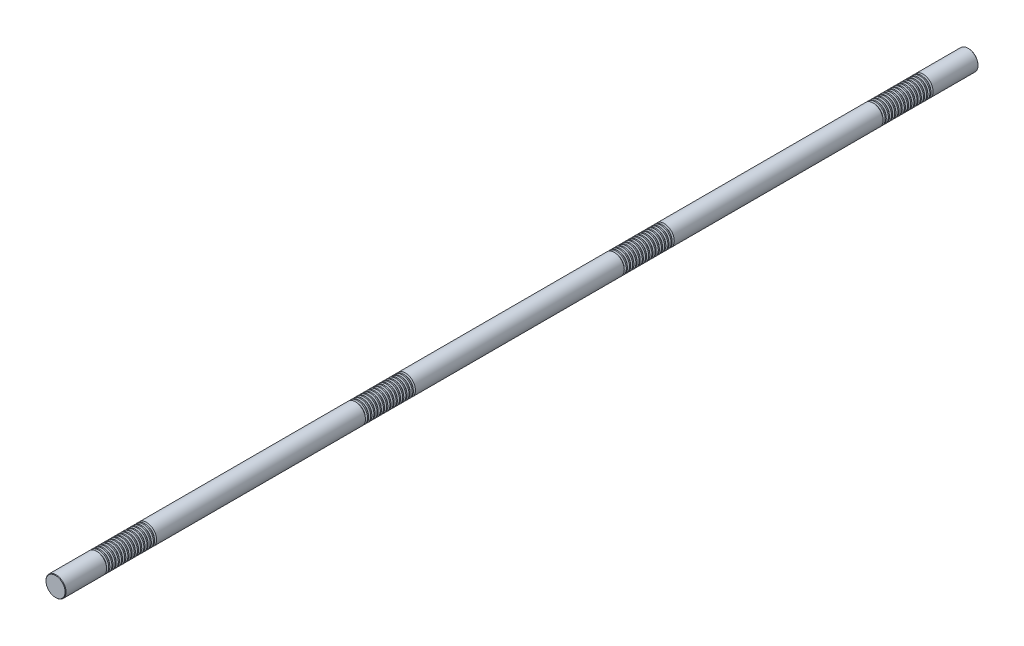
from build123d import *

# Parameters (mm, degrees)
SKETCH1_R           = 22
BOSS_EXTRUDE1_DEPTH = 1000
CHAMFER1_SIZE       = 1.1
LPATTERN1_COUNT     = 16
LPATTERN1_PITCH     = 7
LPATTERN2_COUNT     = 4
LPATTERN2_PITCH     = 567


with BuildPart() as part:
    # Sketch1 → Boss-Extrude1 (new, symmetric)
    with BuildSketch(Plane.XY):
        Circle(SKETCH1_R)
    extrude(amount=BOSS_EXTRUDE1_DEPTH, both=True)

    # Chamfer1
    chamfer1_edges = [part.edges().sort_by_distance(p)[0] for p in [
        (-22, 0, -1000),
        (-22, 0, 1000),
    ]]
    chamfer(chamfer1_edges, length=CHAMFER1_SIZE)

    # Sketch2 → Cut-Revolve1 (revolve, cut)
    with BuildSketch(Plane(origin=(0, 0, 0), x_dir=(0, 0, -1), z_dir=(1, 0, 0)), mode=Mode.PRIVATE) as cut_revolve1_sk:
        Polygon((900.535898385, 22), (895.964101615, 22), (897.035898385, 18), (899.464101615, 18), align=None)
    cut_revolve1 = revolve(cut_revolve1_sk.sketch.rotate(Axis((0, 0, 1000), (0, 0, -1)), 90), axis=Axis((0, 0, 1000), (0, 0, -1)), mode=Mode.SUBTRACT)

    # LPattern1: Cut-Revolve1 ×16
    with Locations(*[(0, 0, i * LPATTERN1_PITCH) for i in range(1, LPATTERN1_COUNT)]):
        add(cut_revolve1, mode=Mode.SUBTRACT)

    # LPattern2: Cut-Revolve1 ×4
    with Locations(*[(0, 0, i * LPATTERN2_PITCH) for i in range(1, LPATTERN2_COUNT)]):
        add(cut_revolve1, mode=Mode.SUBTRACT)

    # LPattern2 copy 1 sketch → LPattern2 copy 1 (revolve, cut)
    with BuildSketch(Plane(origin=(0, 0, 574), x_dir=(0, 0, -1), z_dir=(1, 0, 0))):
        Polygon((900.535898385, 22), (895.964101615, 22), (897.035898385, 18), (899.464101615, 18), align=None)
    revolve(axis=Axis((0, 0, 1574), (0, 0, -1)), mode=Mode.SUBTRACT)

    # LPattern2 copy 2 sketch → LPattern2 copy 2 (revolve, cut)
    with BuildSketch(Plane(origin=(0, 0, 1141), x_dir=(0, 0, -1), z_dir=(1, 0, 0))):
        Polygon((900.535898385, 22), (895.964101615, 22), (897.035898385, 18), (899.464101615, 18), align=None)
    revolve(axis=Axis((0, 0, 2141), (0, 0, -1)), mode=Mode.SUBTRACT)

    # LPattern2 copy 3 sketch → LPattern2 copy 3 (revolve, cut)
    with BuildSketch(Plane(origin=(0, 0, 1708), x_dir=(0, 0, -1), z_dir=(1, 0, 0))):
        Polygon((900.535898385, 22), (895.964101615, 22), (897.035898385, 18), (899.464101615, 18), align=None)
    revolve(axis=Axis((0, 0, 2708), (0, 0, -1)), mode=Mode.SUBTRACT)

    # LPattern2 copy 4 sketch → LPattern2 copy 4 (revolve, cut)
    with BuildSketch(Plane(origin=(0, 0, 581), x_dir=(0, 0, -1), z_dir=(1, 0, 0))):
        Polygon((900.535898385, 22), (895.964101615, 22), (897.035898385, 18), (899.464101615, 18), align=None)
    revolve(axis=Axis((0, 0, 1581), (0, 0, -1)), mode=Mode.SUBTRACT)

    # LPattern2 copy 5 sketch → LPattern2 copy 5 (revolve, cut)
    with BuildSketch(Plane(origin=(0, 0, 1148), x_dir=(0, 0, -1), z_dir=(1, 0, 0))):
        Polygon((900.535898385, 22), (895.964101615, 22), (897.035898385, 18), (899.464101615, 18), align=None)
    revolve(axis=Axis((0, 0, 2148), (0, 0, -1)), mode=Mode.SUBTRACT)

    # LPattern2 copy 6 sketch → LPattern2 copy 6 (revolve, cut)
    with BuildSketch(Plane(origin=(0, 0, 1715), x_dir=(0, 0, -1), z_dir=(1, 0, 0))):
        Polygon((900.535898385, 22), (895.964101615, 22), (897.035898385, 18), (899.464101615, 18), align=None)
    revolve(axis=Axis((0, 0, 2715), (0, 0, -1)), mode=Mode.SUBTRACT)

    # LPattern2 copy 7 sketch → LPattern2 copy 7 (revolve, cut)
    with BuildSketch(Plane(origin=(0, 0, 588), x_dir=(0, 0, -1), z_dir=(1, 0, 0))):
        Polygon((900.535898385, 22), (895.964101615, 22), (897.035898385, 18), (899.464101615, 18), align=None)
    revolve(axis=Axis((0, 0, 1588), (0, 0, -1)), mode=Mode.SUBTRACT)

    # LPattern2 copy 8 sketch → LPattern2 copy 8 (revolve, cut)
    with BuildSketch(Plane(origin=(0, 0, 1155), x_dir=(0, 0, -1), z_dir=(1, 0, 0))):
        Polygon((900.535898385, 22), (895.964101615, 22), (897.035898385, 18), (899.464101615, 18), align=None)
    revolve(axis=Axis((0, 0, 2155), (0, 0, -1)), mode=Mode.SUBTRACT)

    # LPattern2 copy 9 sketch → LPattern2 copy 9 (revolve, cut)
    with BuildSketch(Plane(origin=(0, 0, 1722), x_dir=(0, 0, -1), z_dir=(1, 0, 0))):
        Polygon((900.535898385, 22), (895.964101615, 22), (897.035898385, 18), (899.464101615, 18), align=None)
    revolve(axis=Axis((0, 0, 2722), (0, 0, -1)), mode=Mode.SUBTRACT)

    # LPattern2 copy 10 sketch → LPattern2 copy 10 (revolve, cut)
    with BuildSketch(Plane(origin=(0, 0, 595), x_dir=(0, 0, -1), z_dir=(1, 0, 0))):
        Polygon((900.535898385, 22), (895.964101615, 22), (897.035898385, 18), (899.464101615, 18), align=None)
    revolve(axis=Axis((0, 0, 1595), (0, 0, -1)), mode=Mode.SUBTRACT)

    # LPattern2 copy 11 sketch → LPattern2 copy 11 (revolve, cut)
    with BuildSketch(Plane(origin=(0, 0, 1162), x_dir=(0, 0, -1), z_dir=(1, 0, 0))):
        Polygon((900.535898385, 22), (895.964101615, 22), (897.035898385, 18), (899.464101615, 18), align=None)
    revolve(axis=Axis((0, 0, 2162), (0, 0, -1)), mode=Mode.SUBTRACT)

    # LPattern2 copy 12 sketch → LPattern2 copy 12 (revolve, cut)
    with BuildSketch(Plane(origin=(0, 0, 1729), x_dir=(0, 0, -1), z_dir=(1, 0, 0))):
        Polygon((900.535898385, 22), (895.964101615, 22), (897.035898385, 18), (899.464101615, 18), align=None)
    revolve(axis=Axis((0, 0, 2729), (0, 0, -1)), mode=Mode.SUBTRACT)

    # LPattern2 copy 13 sketch → LPattern2 copy 13 (revolve, cut)
    with BuildSketch(Plane(origin=(0, 0, 602), x_dir=(0, 0, -1), z_dir=(1, 0, 0))):
        Polygon((900.535898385, 22), (895.964101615, 22), (897.035898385, 18), (899.464101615, 18), align=None)
    revolve(axis=Axis((0, 0, 1602), (0, 0, -1)), mode=Mode.SUBTRACT)

    # LPattern2 copy 14 sketch → LPattern2 copy 14 (revolve, cut)
    with BuildSketch(Plane(origin=(0, 0, 1169), x_dir=(0, 0, -1), z_dir=(1, 0, 0))):
        Polygon((900.535898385, 22), (895.964101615, 22), (897.035898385, 18), (899.464101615, 18), align=None)
    revolve(axis=Axis((0, 0, 2169), (0, 0, -1)), mode=Mode.SUBTRACT)

    # LPattern2 copy 15 sketch → LPattern2 copy 15 (revolve, cut)
    with BuildSketch(Plane(origin=(0, 0, 1736), x_dir=(0, 0, -1), z_dir=(1, 0, 0))):
        Polygon((900.535898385, 22), (895.964101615, 22), (897.035898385, 18), (899.464101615, 18), align=None)
    revolve(axis=Axis((0, 0, 2736), (0, 0, -1)), mode=Mode.SUBTRACT)

    # LPattern2 copy 16 sketch → LPattern2 copy 16 (revolve, cut)
    with BuildSketch(Plane(origin=(0, 0, 609), x_dir=(0, 0, -1), z_dir=(1, 0, 0))):
        Polygon((900.535898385, 22), (895.964101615, 22), (897.035898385, 18), (899.464101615, 18), align=None)
    revolve(axis=Axis((0, 0, 1609), (0, 0, -1)), mode=Mode.SUBTRACT)

    # LPattern2 copy 17 sketch → LPattern2 copy 17 (revolve, cut)
    with BuildSketch(Plane(origin=(0, 0, 1176), x_dir=(0, 0, -1), z_dir=(1, 0, 0))):
        Polygon((900.535898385, 22), (895.964101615, 22), (897.035898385, 18), (899.464101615, 18), align=None)
    revolve(axis=Axis((0, 0, 2176), (0, 0, -1)), mode=Mode.SUBTRACT)

    # LPattern2 copy 18 sketch → LPattern2 copy 18 (revolve, cut)
    with BuildSketch(Plane(origin=(0, 0, 1743), x_dir=(0, 0, -1), z_dir=(1, 0, 0))):
        Polygon((900.535898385, 22), (895.964101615, 22), (897.035898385, 18), (899.464101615, 18), align=None)
    revolve(axis=Axis((0, 0, 2743), (0, 0, -1)), mode=Mode.SUBTRACT)

    # LPattern2 copy 19 sketch → LPattern2 copy 19 (revolve, cut)
    with BuildSketch(Plane(origin=(0, 0, 616), x_dir=(0, 0, -1), z_dir=(1, 0, 0))):
        Polygon((900.535898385, 22), (895.964101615, 22), (897.035898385, 18), (899.464101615, 18), align=None)
    revolve(axis=Axis((0, 0, 1616), (0, 0, -1)), mode=Mode.SUBTRACT)

    # LPattern2 copy 20 sketch → LPattern2 copy 20 (revolve, cut)
    with BuildSketch(Plane(origin=(0, 0, 1183), x_dir=(0, 0, -1), z_dir=(1, 0, 0))):
        Polygon((900.535898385, 22), (895.964101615, 22), (897.035898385, 18), (899.464101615, 18), align=None)
    revolve(axis=Axis((0, 0, 2183), (0, 0, -1)), mode=Mode.SUBTRACT)

    # LPattern2 copy 21 sketch → LPattern2 copy 21 (revolve, cut)
    with BuildSketch(Plane(origin=(0, 0, 1750), x_dir=(0, 0, -1), z_dir=(1, 0, 0))):
        Polygon((900.535898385, 22), (895.964101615, 22), (897.035898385, 18), (899.464101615, 18), align=None)
    revolve(axis=Axis((0, 0, 2750), (0, 0, -1)), mode=Mode.SUBTRACT)

    # LPattern2 copy 22 sketch → LPattern2 copy 22 (revolve, cut)
    with BuildSketch(Plane(origin=(0, 0, 623), x_dir=(0, 0, -1), z_dir=(1, 0, 0))):
        Polygon((900.535898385, 22), (895.964101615, 22), (897.035898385, 18), (899.464101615, 18), align=None)
    revolve(axis=Axis((0, 0, 1623), (0, 0, -1)), mode=Mode.SUBTRACT)

    # LPattern2 copy 23 sketch → LPattern2 copy 23 (revolve, cut)
    with BuildSketch(Plane(origin=(0, 0, 1190), x_dir=(0, 0, -1), z_dir=(1, 0, 0))):
        Polygon((900.535898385, 22), (895.964101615, 22), (897.035898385, 18), (899.464101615, 18), align=None)
    revolve(axis=Axis((0, 0, 2190), (0, 0, -1)), mode=Mode.SUBTRACT)

    # LPattern2 copy 24 sketch → LPattern2 copy 24 (revolve, cut)
    with BuildSketch(Plane(origin=(0, 0, 1757), x_dir=(0, 0, -1), z_dir=(1, 0, 0))):
        Polygon((900.535898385, 22), (895.964101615, 22), (897.035898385, 18), (899.464101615, 18), align=None)
    revolve(axis=Axis((0, 0, 2757), (0, 0, -1)), mode=Mode.SUBTRACT)

    # LPattern2 copy 25 sketch → LPattern2 copy 25 (revolve, cut)
    with BuildSketch(Plane(origin=(0, 0, 630), x_dir=(0, 0, -1), z_dir=(1, 0, 0))):
        Polygon((900.535898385, 22), (895.964101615, 22), (897.035898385, 18), (899.464101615, 18), align=None)
    revolve(axis=Axis((0, 0, 1630), (0, 0, -1)), mode=Mode.SUBTRACT)

    # LPattern2 copy 26 sketch → LPattern2 copy 26 (revolve, cut)
    with BuildSketch(Plane(origin=(0, 0, 1197), x_dir=(0, 0, -1), z_dir=(1, 0, 0))):
        Polygon((900.535898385, 22), (895.964101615, 22), (897.035898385, 18), (899.464101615, 18), align=None)
    revolve(axis=Axis((0, 0, 2197), (0, 0, -1)), mode=Mode.SUBTRACT)

    # LPattern2 copy 27 sketch → LPattern2 copy 27 (revolve, cut)
    with BuildSketch(Plane(origin=(0, 0, 1764), x_dir=(0, 0, -1), z_dir=(1, 0, 0))):
        Polygon((900.535898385, 22), (895.964101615, 22), (897.035898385, 18), (899.464101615, 18), align=None)
    revolve(axis=Axis((0, 0, 2764), (0, 0, -1)), mode=Mode.SUBTRACT)

    # LPattern2 copy 28 sketch → LPattern2 copy 28 (revolve, cut)
    with BuildSketch(Plane(origin=(0, 0, 637), x_dir=(0, 0, -1), z_dir=(1, 0, 0))):
        Polygon((900.535898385, 22), (895.964101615, 22), (897.035898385, 18), (899.464101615, 18), align=None)
    revolve(axis=Axis((0, 0, 1637), (0, 0, -1)), mode=Mode.SUBTRACT)

    # LPattern2 copy 29 sketch → LPattern2 copy 29 (revolve, cut)
    with BuildSketch(Plane(origin=(0, 0, 1204), x_dir=(0, 0, -1), z_dir=(1, 0, 0))):
        Polygon((900.535898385, 22), (895.964101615, 22), (897.035898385, 18), (899.464101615, 18), align=None)
    revolve(axis=Axis((0, 0, 2204), (0, 0, -1)), mode=Mode.SUBTRACT)

    # LPattern2 copy 30 sketch → LPattern2 copy 30 (revolve, cut)
    with BuildSketch(Plane(origin=(0, 0, 1771), x_dir=(0, 0, -1), z_dir=(1, 0, 0))):
        Polygon((900.535898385, 22), (895.964101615, 22), (897.035898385, 18), (899.464101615, 18), align=None)
    revolve(axis=Axis((0, 0, 2771), (0, 0, -1)), mode=Mode.SUBTRACT)

    # LPattern2 copy 31 sketch → LPattern2 copy 31 (revolve, cut)
    with BuildSketch(Plane(origin=(0, 0, 644), x_dir=(0, 0, -1), z_dir=(1, 0, 0))):
        Polygon((900.535898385, 22), (895.964101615, 22), (897.035898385, 18), (899.464101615, 18), align=None)
    revolve(axis=Axis((0, 0, 1644), (0, 0, -1)), mode=Mode.SUBTRACT)

    # LPattern2 copy 32 sketch → LPattern2 copy 32 (revolve, cut)
    with BuildSketch(Plane(origin=(0, 0, 1211), x_dir=(0, 0, -1), z_dir=(1, 0, 0))):
        Polygon((900.535898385, 22), (895.964101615, 22), (897.035898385, 18), (899.464101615, 18), align=None)
    revolve(axis=Axis((0, 0, 2211), (0, 0, -1)), mode=Mode.SUBTRACT)

    # LPattern2 copy 33 sketch → LPattern2 copy 33 (revolve, cut)
    with BuildSketch(Plane(origin=(0, 0, 1778), x_dir=(0, 0, -1), z_dir=(1, 0, 0))):
        Polygon((900.535898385, 22), (895.964101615, 22), (897.035898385, 18), (899.464101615, 18), align=None)
    revolve(axis=Axis((0, 0, 2778), (0, 0, -1)), mode=Mode.SUBTRACT)

    # LPattern2 copy 34 sketch → LPattern2 copy 34 (revolve, cut)
    with BuildSketch(Plane(origin=(0, 0, 651), x_dir=(0, 0, -1), z_dir=(1, 0, 0))):
        Polygon((900.535898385, 22), (895.964101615, 22), (897.035898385, 18), (899.464101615, 18), align=None)
    revolve(axis=Axis((0, 0, 1651), (0, 0, -1)), mode=Mode.SUBTRACT)

    # LPattern2 copy 35 sketch → LPattern2 copy 35 (revolve, cut)
    with BuildSketch(Plane(origin=(0, 0, 1218), x_dir=(0, 0, -1), z_dir=(1, 0, 0))):
        Polygon((900.535898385, 22), (895.964101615, 22), (897.035898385, 18), (899.464101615, 18), align=None)
    revolve(axis=Axis((0, 0, 2218), (0, 0, -1)), mode=Mode.SUBTRACT)

    # LPattern2 copy 36 sketch → LPattern2 copy 36 (revolve, cut)
    with BuildSketch(Plane(origin=(0, 0, 1785), x_dir=(0, 0, -1), z_dir=(1, 0, 0))):
        Polygon((900.535898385, 22), (895.964101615, 22), (897.035898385, 18), (899.464101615, 18), align=None)
    revolve(axis=Axis((0, 0, 2785), (0, 0, -1)), mode=Mode.SUBTRACT)

    # LPattern2 copy 37 sketch → LPattern2 copy 37 (revolve, cut)
    with BuildSketch(Plane(origin=(0, 0, 658), x_dir=(0, 0, -1), z_dir=(1, 0, 0))):
        Polygon((900.535898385, 22), (895.964101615, 22), (897.035898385, 18), (899.464101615, 18), align=None)
    revolve(axis=Axis((0, 0, 1658), (0, 0, -1)), mode=Mode.SUBTRACT)

    # LPattern2 copy 38 sketch → LPattern2 copy 38 (revolve, cut)
    with BuildSketch(Plane(origin=(0, 0, 1225), x_dir=(0, 0, -1), z_dir=(1, 0, 0))):
        Polygon((900.535898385, 22), (895.964101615, 22), (897.035898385, 18), (899.464101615, 18), align=None)
    revolve(axis=Axis((0, 0, 2225), (0, 0, -1)), mode=Mode.SUBTRACT)

    # LPattern2 copy 39 sketch → LPattern2 copy 39 (revolve, cut)
    with BuildSketch(Plane(origin=(0, 0, 1792), x_dir=(0, 0, -1), z_dir=(1, 0, 0))):
        Polygon((900.535898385, 22), (895.964101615, 22), (897.035898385, 18), (899.464101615, 18), align=None)
    revolve(axis=Axis((0, 0, 2792), (0, 0, -1)), mode=Mode.SUBTRACT)

    # LPattern2 copy 40 sketch → LPattern2 copy 40 (revolve, cut)
    with BuildSketch(Plane(origin=(0, 0, 665), x_dir=(0, 0, -1), z_dir=(1, 0, 0))):
        Polygon((900.535898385, 22), (895.964101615, 22), (897.035898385, 18), (899.464101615, 18), align=None)
    revolve(axis=Axis((0, 0, 1665), (0, 0, -1)), mode=Mode.SUBTRACT)

    # LPattern2 copy 41 sketch → LPattern2 copy 41 (revolve, cut)
    with BuildSketch(Plane(origin=(0, 0, 1232), x_dir=(0, 0, -1), z_dir=(1, 0, 0))):
        Polygon((900.535898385, 22), (895.964101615, 22), (897.035898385, 18), (899.464101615, 18), align=None)
    revolve(axis=Axis((0, 0, 2232), (0, 0, -1)), mode=Mode.SUBTRACT)

    # LPattern2 copy 42 sketch → LPattern2 copy 42 (revolve, cut)
    with BuildSketch(Plane(origin=(0, 0, 1799), x_dir=(0, 0, -1), z_dir=(1, 0, 0))):
        Polygon((900.535898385, 22), (895.964101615, 22), (897.035898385, 18), (899.464101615, 18), align=None)
    revolve(axis=Axis((0, 0, 2799), (0, 0, -1)), mode=Mode.SUBTRACT)

    # LPattern2 copy 43 sketch → LPattern2 copy 43 (revolve, cut)
    with BuildSketch(Plane(origin=(0, 0, 672), x_dir=(0, 0, -1), z_dir=(1, 0, 0))):
        Polygon((900.535898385, 22), (895.964101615, 22), (897.035898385, 18), (899.464101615, 18), align=None)
    revolve(axis=Axis((0, 0, 1672), (0, 0, -1)), mode=Mode.SUBTRACT)

    # LPattern2 copy 44 sketch → LPattern2 copy 44 (revolve, cut)
    with BuildSketch(Plane(origin=(0, 0, 1239), x_dir=(0, 0, -1), z_dir=(1, 0, 0))):
        Polygon((900.535898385, 22), (895.964101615, 22), (897.035898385, 18), (899.464101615, 18), align=None)
    revolve(axis=Axis((0, 0, 2239), (0, 0, -1)), mode=Mode.SUBTRACT)

    # LPattern2 copy 45 sketch → LPattern2 copy 45 (revolve, cut)
    with BuildSketch(Plane(origin=(0, 0, 1806), x_dir=(0, 0, -1), z_dir=(1, 0, 0))):
        Polygon((900.535898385, 22), (895.964101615, 22), (897.035898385, 18), (899.464101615, 18), align=None)
    revolve(axis=Axis((0, 0, 2806), (0, 0, -1)), mode=Mode.SUBTRACT)


solid = part.part
